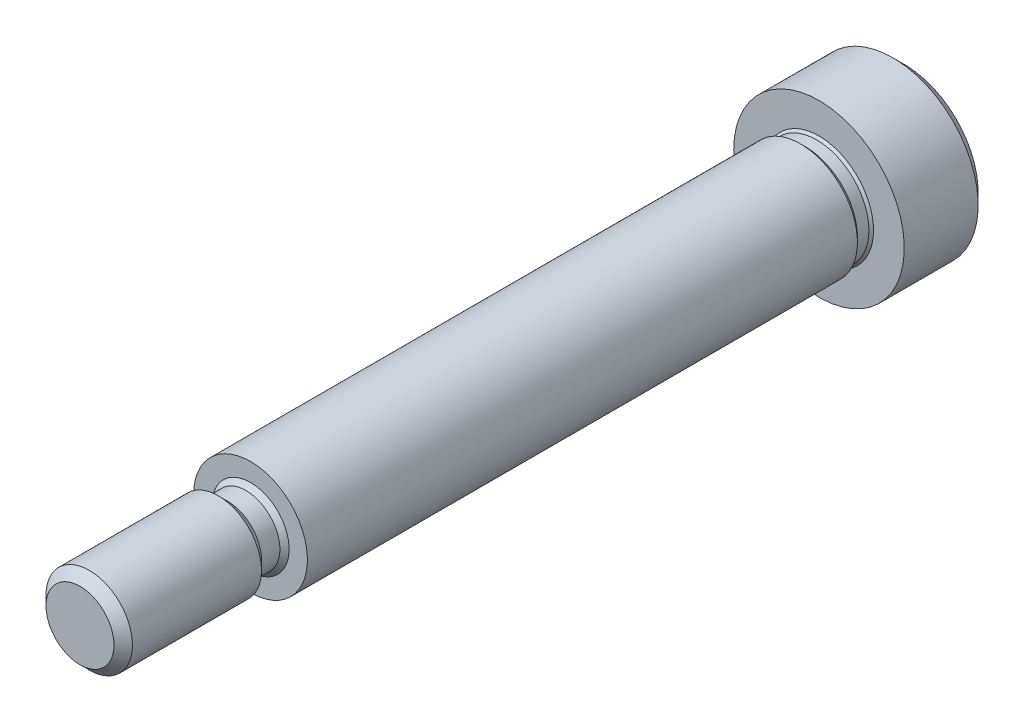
from build123d import *

# Parameters (mm, degrees)
CUT_EXTRUDE1_DEPTH = 3.175


with BuildPart() as part:
    # Logo3_bib1 → Revolve1 (revolve)
    with BuildSketch(Plane(origin=(0, 0, 0), x_dir=(-1, 0, 0), z_dir=(0, -1, 0))):
        Polygon((3.175, 0), (2.155825, 0), (1.89865, -0.257175), (1.89865, -1.285875), (2.413, -1.800225), (2.413, -9.01065), (1.89865, -9.525), (0, -9.525), (0, 36.5125), (4.1275, 36.5125), (4.7625, 35.8775), (4.7625, 31.75), (3.0464125, 31.75), (2.917825, 31.6214125), (2.917825, 30.978475), (3.175, 30.7213), align=None)
    revolve(axis=Axis((0, 0, -62.352722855), (0, 0, 1)))

    # Logo3_bib2 → Cut-Extrude1 (cut)
    with BuildSketch(Plane(origin=(0, 0, -36.5125), x_dir=(1, 0, 0), z_dir=(0, 0, -1))):
        Polygon((1.833087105, 0), (0.916543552, 1.5875), (-0.916543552, 1.5875), (-1.833087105, 0), (-0.916543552, -1.5875), (0.916543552, -1.5875), align=None)
    extrude(amount=-CUT_EXTRUDE1_DEPTH, mode=Mode.SUBTRACT)


solid = part.part
